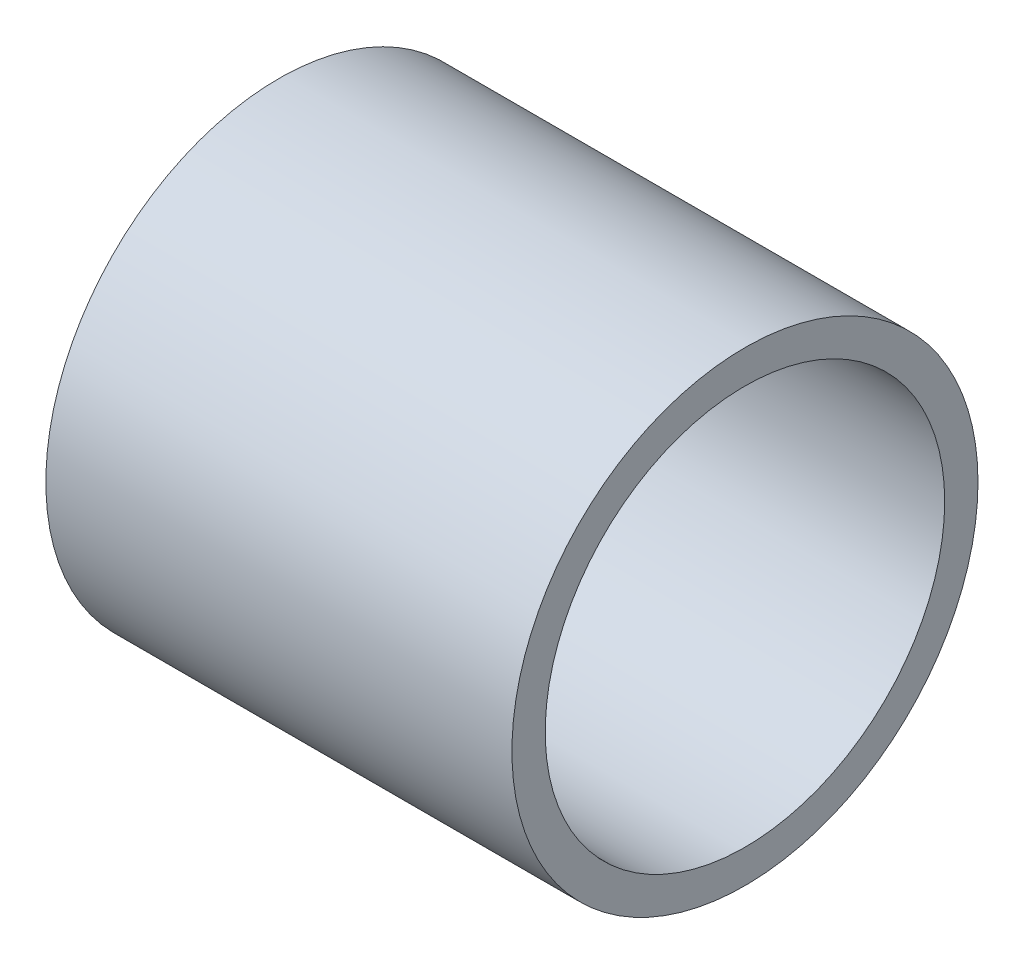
ISO-10303-21;
HEADER;
FILE_DESCRIPTION(('STEP AP214'),'2;1');
FILE_NAME('part.step','',(''),(''),'','','');
FILE_SCHEMA(('AUTOMOTIVE_DESIGN { 1 0 10303 214 1 1 1 1 }'));
ENDSEC;
DATA;
#1=APPLICATION_CONTEXT('core data for automotive mechanical design processes');
#2=APPLICATION_PROTOCOL_DEFINITION('international standard','automotive_design',2000,#1);
#3=PRODUCT_CONTEXT('',#1,'mechanical');
#4=PRODUCT('Part','Part','',(#3));
#5=PRODUCT_RELATED_PRODUCT_CATEGORY('part','',(#4));
#6=PRODUCT_DEFINITION_FORMATION('','',#4);
#7=PRODUCT_DEFINITION_CONTEXT('part definition',#1,'design');
#8=PRODUCT_DEFINITION('design','',#6,#7);
#9=PRODUCT_DEFINITION_SHAPE('','',#8);
#10=(LENGTH_UNIT() NAMED_UNIT(*) SI_UNIT(.MILLI.,.METRE.));
#11=(NAMED_UNIT(*) PLANE_ANGLE_UNIT() SI_UNIT($,.RADIAN.));
#12=(NAMED_UNIT(*) SI_UNIT($,.STERADIAN.) SOLID_ANGLE_UNIT());
#13=UNCERTAINTY_MEASURE_WITH_UNIT(LENGTH_MEASURE(1.E-05),#10,'distance_accuracy_value','');
#14=(GEOMETRIC_REPRESENTATION_CONTEXT(3) GLOBAL_UNCERTAINTY_ASSIGNED_CONTEXT((#13)) GLOBAL_UNIT_ASSIGNED_CONTEXT((#10,
#11,#12)) REPRESENTATION_CONTEXT('',''));
#15=CARTESIAN_POINT('',(0.,0.,0.));
#16=DIRECTION('',(0.,0.,1.));
#17=DIRECTION('',(1.,0.,0.));
#18=AXIS2_PLACEMENT_3D('',#15,#16,#17);
#19=CARTESIAN_POINT('',(88.9,0.,0.));
#20=DIRECTION('',(-1.,0.,0.));
#21=DIRECTION('',(0.,0.,1.));
#22=AXIS2_PLACEMENT_3D('',#19,#20,#21);
#23=CYLINDRICAL_SURFACE('',#22,38.1);
#24=CARTESIAN_POINT('',(88.9,0.,0.));
#25=DIRECTION('',(1.,0.,0.));
#26=DIRECTION('',(0.,0.,-1.));
#27=AXIS2_PLACEMENT_3D('',#24,#25,#26);
#28=CIRCLE('',#27,38.1);
#29=CARTESIAN_POINT('',(88.9,0.,-38.1));
#30=VERTEX_POINT('',#29);
#31=EDGE_CURVE('E53',#30,#30,#28,.T.);
#32=ORIENTED_EDGE('',*,*,#31,.T.);
#33=EDGE_LOOP('',(#32));
#34=FACE_BOUND('',#33,.T.);
#35=CARTESIAN_POINT('',(0.,0.,0.));
#36=DIRECTION('',(1.,0.,0.));
#37=DIRECTION('',(0.,0.,-1.));
#38=AXIS2_PLACEMENT_3D('',#35,#36,#37);
#39=CIRCLE('',#38,38.1);
#40=CARTESIAN_POINT('',(0.,0.,-38.1));
#41=VERTEX_POINT('',#40);
#42=EDGE_CURVE('E60',#41,#41,#39,.T.);
#43=ORIENTED_EDGE('',*,*,#42,.F.);
#44=EDGE_LOOP('',(#43));
#45=FACE_BOUND('',#44,.T.);
#46=ADVANCED_FACE('F45',(#34,#45),#23,.F.);
#47=CARTESIAN_POINT('',(88.9,0.,0.));
#48=DIRECTION('',(-1.,0.,0.));
#49=DIRECTION('',(0.,0.,1.));
#50=AXIS2_PLACEMENT_3D('',#47,#48,#49);
#51=CYLINDRICAL_SURFACE('',#50,44.45);
#52=CARTESIAN_POINT('',(88.9,0.,0.));
#53=DIRECTION('',(1.,0.,0.));
#54=DIRECTION('',(0.,0.,-1.));
#55=AXIS2_PLACEMENT_3D('',#52,#53,#54);
#56=CIRCLE('',#55,44.45);
#57=CARTESIAN_POINT('',(88.9,0.,-44.45));
#58=VERTEX_POINT('',#57);
#59=EDGE_CURVE('E10',#58,#58,#56,.T.);
#60=ORIENTED_EDGE('',*,*,#59,.F.);
#61=EDGE_LOOP('',(#60));
#62=FACE_BOUND('',#61,.T.);
#63=CARTESIAN_POINT('',(0.,0.,0.));
#64=DIRECTION('',(1.,0.,0.));
#65=DIRECTION('',(0.,0.,-1.));
#66=AXIS2_PLACEMENT_3D('',#63,#64,#65);
#67=CIRCLE('',#66,44.45);
#68=CARTESIAN_POINT('',(0.,0.,-44.45));
#69=VERTEX_POINT('',#68);
#70=EDGE_CURVE('E48',#69,#69,#67,.T.);
#71=ORIENTED_EDGE('',*,*,#70,.T.);
#72=EDGE_LOOP('',(#71));
#73=FACE_BOUND('',#72,.T.);
#74=ADVANCED_FACE('F69',(#62,#73),#51,.T.);
#75=CARTESIAN_POINT('',(88.9,0.,0.));
#76=DIRECTION('',(1.,0.,0.));
#77=DIRECTION('',(0.,0.,-1.));
#78=AXIS2_PLACEMENT_3D('',#75,#76,#77);
#79=PLANE('',#78);
#80=ORIENTED_EDGE('',*,*,#31,.F.);
#81=EDGE_LOOP('',(#80));
#82=FACE_BOUND('',#81,.T.);
#83=ORIENTED_EDGE('',*,*,#59,.T.);
#84=EDGE_LOOP('',(#83));
#85=FACE_BOUND('',#84,.T.);
#86=ADVANCED_FACE('F73',(#82,#85),#79,.T.);
#87=CARTESIAN_POINT('',(0.,0.,0.));
#88=DIRECTION('',(1.,0.,0.));
#89=DIRECTION('',(0.,0.,-1.));
#90=AXIS2_PLACEMENT_3D('',#87,#88,#89);
#91=PLANE('',#90);
#92=ORIENTED_EDGE('',*,*,#42,.T.);
#93=EDGE_LOOP('',(#92));
#94=FACE_BOUND('',#93,.T.);
#95=ORIENTED_EDGE('',*,*,#70,.F.);
#96=EDGE_LOOP('',(#95));
#97=FACE_BOUND('',#96,.T.);
#98=ADVANCED_FACE('F71',(#94,#97),#91,.F.);
#99=CLOSED_SHELL('',(#46,#74,#86,#98));
#100=MANIFOLD_SOLID_BREP('B2',#99);
#101=ADVANCED_BREP_SHAPE_REPRESENTATION('',(#18,#100),#14);
#102=SHAPE_DEFINITION_REPRESENTATION(#9,#101);
ENDSEC;
END-ISO-10303-21;
